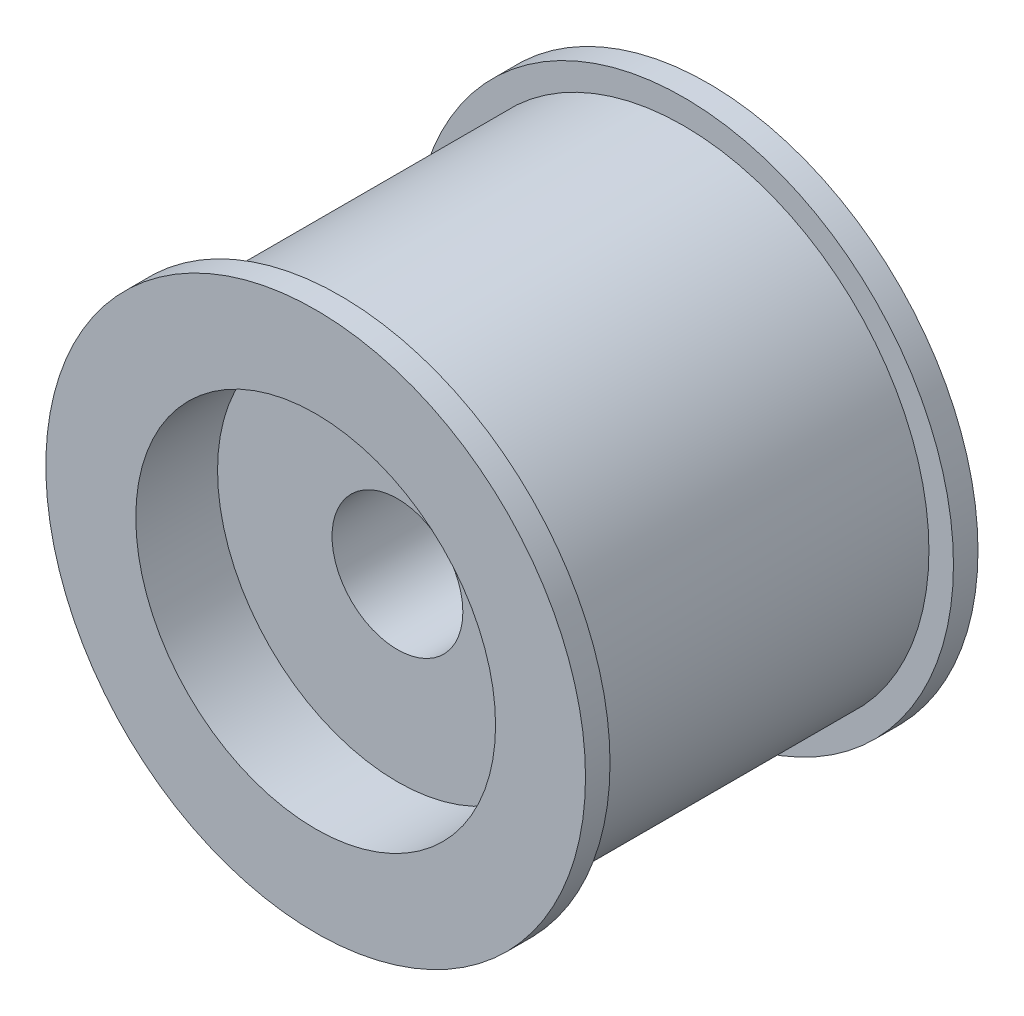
ISO-10303-21;
HEADER;
FILE_DESCRIPTION(('STEP AP214'),'2;1');
FILE_NAME('part.step','',(''),(''),'','','');
FILE_SCHEMA(('AUTOMOTIVE_DESIGN { 1 0 10303 214 1 1 1 1 }'));
ENDSEC;
DATA;
#1=APPLICATION_CONTEXT('core data for automotive mechanical design processes');
#2=APPLICATION_PROTOCOL_DEFINITION('international standard','automotive_design',2000,#1);
#3=PRODUCT_CONTEXT('',#1,'mechanical');
#4=PRODUCT('Part','Part','',(#3));
#5=PRODUCT_RELATED_PRODUCT_CATEGORY('part','',(#4));
#6=PRODUCT_DEFINITION_FORMATION('','',#4);
#7=PRODUCT_DEFINITION_CONTEXT('part definition',#1,'design');
#8=PRODUCT_DEFINITION('design','',#6,#7);
#9=PRODUCT_DEFINITION_SHAPE('','',#8);
#10=(LENGTH_UNIT() NAMED_UNIT(*) SI_UNIT(.MILLI.,.METRE.));
#11=(NAMED_UNIT(*) PLANE_ANGLE_UNIT() SI_UNIT($,.RADIAN.));
#12=(NAMED_UNIT(*) SI_UNIT($,.STERADIAN.) SOLID_ANGLE_UNIT());
#13=UNCERTAINTY_MEASURE_WITH_UNIT(LENGTH_MEASURE(1.E-05),#10,'distance_accuracy_value','');
#14=(GEOMETRIC_REPRESENTATION_CONTEXT(3) GLOBAL_UNCERTAINTY_ASSIGNED_CONTEXT((#13)) GLOBAL_UNIT_ASSIGNED_CONTEXT((#10,
#11,#12)) REPRESENTATION_CONTEXT('',''));
#15=CARTESIAN_POINT('',(0.,0.,0.));
#16=DIRECTION('',(0.,0.,1.));
#17=DIRECTION('',(1.,0.,0.));
#18=AXIS2_PLACEMENT_3D('',#15,#16,#17);
#19=CARTESIAN_POINT('',(0.,0.,18.3646380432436));
#20=DIRECTION('',(0.,0.,1.));
#21=DIRECTION('',(1.,0.,0.));
#22=AXIS2_PLACEMENT_3D('',#19,#20,#21);
#23=CYLINDRICAL_SURFACE('',#22,9.);
#24=CARTESIAN_POINT('',(0.,0.,-12.));
#25=DIRECTION('',(0.,0.,1.));
#26=DIRECTION('',(1.,0.,0.));
#27=AXIS2_PLACEMENT_3D('',#24,#25,#26);
#28=CIRCLE('',#27,9.);
#29=CARTESIAN_POINT('',(9.,0.,-12.));
#30=VERTEX_POINT('',#29);
#31=EDGE_CURVE('E8',#30,#30,#28,.T.);
#32=ORIENTED_EDGE('',*,*,#31,.F.);
#33=EDGE_LOOP('',(#32));
#34=FACE_BOUND('',#33,.T.);
#35=CARTESIAN_POINT('',(0.,0.,-7.));
#36=DIRECTION('',(0.,0.,1.));
#37=DIRECTION('',(1.,0.,0.));
#38=AXIS2_PLACEMENT_3D('',#35,#36,#37);
#39=CIRCLE('',#38,9.);
#40=CARTESIAN_POINT('',(9.,0.,-7.));
#41=VERTEX_POINT('',#40);
#42=EDGE_CURVE('E52',#41,#41,#39,.T.);
#43=ORIENTED_EDGE('',*,*,#42,.T.);
#44=EDGE_LOOP('',(#43));
#45=FACE_BOUND('',#44,.T.);
#46=ADVANCED_FACE('F12',(#34,#45),#23,.F.);
#47=CARTESIAN_POINT('',(0.,9.,-12.));
#48=DIRECTION('',(0.,0.,1.));
#49=DIRECTION('',(1.,0.,0.));
#50=AXIS2_PLACEMENT_3D('',#47,#48,#49);
#51=PLANE('',#50);
#52=CARTESIAN_POINT('',(0.,0.,-12.));
#53=DIRECTION('',(0.,0.,1.));
#54=DIRECTION('',(1.,0.,0.));
#55=AXIS2_PLACEMENT_3D('',#52,#53,#54);
#56=CIRCLE('',#55,16.5);
#57=CARTESIAN_POINT('',(16.5,0.,-12.));
#58=VERTEX_POINT('',#57);
#59=EDGE_CURVE('E18',#58,#58,#56,.T.);
#60=ORIENTED_EDGE('',*,*,#59,.F.);
#61=EDGE_LOOP('',(#60));
#62=FACE_BOUND('',#61,.T.);
#63=ORIENTED_EDGE('',*,*,#31,.T.);
#64=EDGE_LOOP('',(#63));
#65=FACE_BOUND('',#64,.T.);
#66=ADVANCED_FACE('F113',(#62,#65),#51,.F.);
#67=CARTESIAN_POINT('',(0.,0.,18.3646380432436));
#68=DIRECTION('',(0.,0.,1.));
#69=DIRECTION('',(1.,0.,0.));
#70=AXIS2_PLACEMENT_3D('',#67,#68,#69);
#71=CYLINDRICAL_SURFACE('',#70,16.5);
#72=CARTESIAN_POINT('',(0.,0.,-10.5));
#73=DIRECTION('',(0.,0.,1.));
#74=DIRECTION('',(1.,0.,0.));
#75=AXIS2_PLACEMENT_3D('',#72,#73,#74);
#76=CIRCLE('',#75,16.5);
#77=CARTESIAN_POINT('',(16.5,0.,-10.5));
#78=VERTEX_POINT('',#77);
#79=EDGE_CURVE('E22',#78,#78,#76,.T.);
#80=ORIENTED_EDGE('',*,*,#79,.F.);
#81=EDGE_LOOP('',(#80));
#82=FACE_BOUND('',#81,.T.);
#83=ORIENTED_EDGE('',*,*,#59,.T.);
#84=EDGE_LOOP('',(#83));
#85=FACE_BOUND('',#84,.T.);
#86=ADVANCED_FACE('F108',(#82,#85),#71,.T.);
#87=CARTESIAN_POINT('',(0.,16.5,-10.5));
#88=DIRECTION('',(0.,0.,-1.));
#89=DIRECTION('',(-1.,0.,0.));
#90=AXIS2_PLACEMENT_3D('',#87,#88,#89);
#91=PLANE('',#90);
#92=CARTESIAN_POINT('',(0.,0.,-10.5));
#93=DIRECTION('',(0.,0.,1.));
#94=DIRECTION('',(1.,0.,0.));
#95=AXIS2_PLACEMENT_3D('',#92,#93,#94);
#96=CIRCLE('',#95,15.);
#97=CARTESIAN_POINT('',(15.,0.,-10.5));
#98=VERTEX_POINT('',#97);
#99=EDGE_CURVE('E26',#98,#98,#96,.T.);
#100=ORIENTED_EDGE('',*,*,#99,.F.);
#101=EDGE_LOOP('',(#100));
#102=FACE_BOUND('',#101,.T.);
#103=ORIENTED_EDGE('',*,*,#79,.T.);
#104=EDGE_LOOP('',(#103));
#105=FACE_BOUND('',#104,.T.);
#106=ADVANCED_FACE('F102',(#102,#105),#91,.F.);
#107=CARTESIAN_POINT('',(0.,0.,18.3646380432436));
#108=DIRECTION('',(0.,0.,1.));
#109=DIRECTION('',(1.,0.,0.));
#110=AXIS2_PLACEMENT_3D('',#107,#108,#109);
#111=CYLINDRICAL_SURFACE('',#110,15.);
#112=CARTESIAN_POINT('',(0.,0.,10.5));
#113=DIRECTION('',(0.,0.,1.));
#114=DIRECTION('',(1.,0.,0.));
#115=AXIS2_PLACEMENT_3D('',#112,#113,#114);
#116=CIRCLE('',#115,15.);
#117=CARTESIAN_POINT('',(15.,0.,10.5));
#118=VERTEX_POINT('',#117);
#119=EDGE_CURVE('E31',#118,#118,#116,.T.);
#120=ORIENTED_EDGE('',*,*,#119,.F.);
#121=EDGE_LOOP('',(#120));
#122=FACE_BOUND('',#121,.T.);
#123=ORIENTED_EDGE('',*,*,#99,.T.);
#124=EDGE_LOOP('',(#123));
#125=FACE_BOUND('',#124,.T.);
#126=ADVANCED_FACE('F96',(#122,#125),#111,.T.);
#127=CARTESIAN_POINT('',(0.,15.,10.5));
#128=DIRECTION('',(0.,0.,1.));
#129=DIRECTION('',(1.,0.,0.));
#130=AXIS2_PLACEMENT_3D('',#127,#128,#129);
#131=PLANE('',#130);
#132=CARTESIAN_POINT('',(0.,0.,10.5));
#133=DIRECTION('',(0.,0.,1.));
#134=DIRECTION('',(1.,0.,0.));
#135=AXIS2_PLACEMENT_3D('',#132,#133,#134);
#136=CIRCLE('',#135,16.5);
#137=CARTESIAN_POINT('',(16.5,0.,10.5));
#138=VERTEX_POINT('',#137);
#139=EDGE_CURVE('E34',#138,#138,#136,.T.);
#140=ORIENTED_EDGE('',*,*,#139,.F.);
#141=EDGE_LOOP('',(#140));
#142=FACE_BOUND('',#141,.T.);
#143=ORIENTED_EDGE('',*,*,#119,.T.);
#144=EDGE_LOOP('',(#143));
#145=FACE_BOUND('',#144,.T.);
#146=ADVANCED_FACE('F90',(#142,#145),#131,.F.);
#147=CARTESIAN_POINT('',(0.,0.,18.3646380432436));
#148=DIRECTION('',(0.,0.,1.));
#149=DIRECTION('',(1.,0.,0.));
#150=AXIS2_PLACEMENT_3D('',#147,#148,#149);
#151=CYLINDRICAL_SURFACE('',#150,16.5);
#152=CARTESIAN_POINT('',(0.,0.,12.));
#153=DIRECTION('',(0.,0.,1.));
#154=DIRECTION('',(1.,0.,0.));
#155=AXIS2_PLACEMENT_3D('',#152,#153,#154);
#156=CIRCLE('',#155,16.5);
#157=CARTESIAN_POINT('',(16.5,0.,12.));
#158=VERTEX_POINT('',#157);
#159=EDGE_CURVE('E37',#158,#158,#156,.T.);
#160=ORIENTED_EDGE('',*,*,#159,.F.);
#161=EDGE_LOOP('',(#160));
#162=FACE_BOUND('',#161,.T.);
#163=ORIENTED_EDGE('',*,*,#139,.T.);
#164=EDGE_LOOP('',(#163));
#165=FACE_BOUND('',#164,.T.);
#166=ADVANCED_FACE('F84',(#162,#165),#151,.T.);
#167=CARTESIAN_POINT('',(0.,16.5,12.));
#168=DIRECTION('',(0.,0.,-1.));
#169=DIRECTION('',(-1.,0.,0.));
#170=AXIS2_PLACEMENT_3D('',#167,#168,#169);
#171=PLANE('',#170);
#172=CARTESIAN_POINT('',(0.,0.,12.));
#173=DIRECTION('',(0.,0.,1.));
#174=DIRECTION('',(1.,0.,0.));
#175=AXIS2_PLACEMENT_3D('',#172,#173,#174);
#176=CIRCLE('',#175,11.);
#177=CARTESIAN_POINT('',(11.,0.,12.));
#178=VERTEX_POINT('',#177);
#179=EDGE_CURVE('E40',#178,#178,#176,.T.);
#180=ORIENTED_EDGE('',*,*,#179,.F.);
#181=EDGE_LOOP('',(#180));
#182=FACE_BOUND('',#181,.T.);
#183=ORIENTED_EDGE('',*,*,#159,.T.);
#184=EDGE_LOOP('',(#183));
#185=FACE_BOUND('',#184,.T.);
#186=ADVANCED_FACE('F78',(#182,#185),#171,.F.);
#187=CARTESIAN_POINT('',(0.,0.,18.3646380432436));
#188=DIRECTION('',(0.,0.,1.));
#189=DIRECTION('',(1.,0.,0.));
#190=AXIS2_PLACEMENT_3D('',#187,#188,#189);
#191=CYLINDRICAL_SURFACE('',#190,11.);
#192=CARTESIAN_POINT('',(0.,0.,7.));
#193=DIRECTION('',(0.,0.,1.));
#194=DIRECTION('',(1.,0.,0.));
#195=AXIS2_PLACEMENT_3D('',#192,#193,#194);
#196=CIRCLE('',#195,11.);
#197=CARTESIAN_POINT('',(11.,0.,7.));
#198=VERTEX_POINT('',#197);
#199=EDGE_CURVE('E43',#198,#198,#196,.T.);
#200=ORIENTED_EDGE('',*,*,#199,.F.);
#201=EDGE_LOOP('',(#200));
#202=FACE_BOUND('',#201,.T.);
#203=ORIENTED_EDGE('',*,*,#179,.T.);
#204=EDGE_LOOP('',(#203));
#205=FACE_BOUND('',#204,.T.);
#206=ADVANCED_FACE('F72',(#202,#205),#191,.F.);
#207=CARTESIAN_POINT('',(0.,11.,7.));
#208=DIRECTION('',(0.,0.,-1.));
#209=DIRECTION('',(-1.,0.,0.));
#210=AXIS2_PLACEMENT_3D('',#207,#208,#209);
#211=PLANE('',#210);
#212=CARTESIAN_POINT('',(0.,0.,7.));
#213=DIRECTION('',(0.,0.,1.));
#214=DIRECTION('',(1.,0.,0.));
#215=AXIS2_PLACEMENT_3D('',#212,#213,#214);
#216=CIRCLE('',#215,4.);
#217=CARTESIAN_POINT('',(4.,0.,7.));
#218=VERTEX_POINT('',#217);
#219=EDGE_CURVE('E46',#218,#218,#216,.T.);
#220=ORIENTED_EDGE('',*,*,#219,.F.);
#221=EDGE_LOOP('',(#220));
#222=FACE_BOUND('',#221,.T.);
#223=ORIENTED_EDGE('',*,*,#199,.T.);
#224=EDGE_LOOP('',(#223));
#225=FACE_BOUND('',#224,.T.);
#226=ADVANCED_FACE('F66',(#222,#225),#211,.F.);
#227=CARTESIAN_POINT('',(0.,0.,18.3646380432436));
#228=DIRECTION('',(0.,0.,1.));
#229=DIRECTION('',(1.,0.,0.));
#230=AXIS2_PLACEMENT_3D('',#227,#228,#229);
#231=CYLINDRICAL_SURFACE('',#230,4.);
#232=CARTESIAN_POINT('',(0.,0.,-7.));
#233=DIRECTION('',(0.,0.,1.));
#234=DIRECTION('',(1.,0.,0.));
#235=AXIS2_PLACEMENT_3D('',#232,#233,#234);
#236=CIRCLE('',#235,4.);
#237=CARTESIAN_POINT('',(4.,0.,-7.));
#238=VERTEX_POINT('',#237);
#239=EDGE_CURVE('E49',#238,#238,#236,.T.);
#240=ORIENTED_EDGE('',*,*,#239,.F.);
#241=EDGE_LOOP('',(#240));
#242=FACE_BOUND('',#241,.T.);
#243=ORIENTED_EDGE('',*,*,#219,.T.);
#244=EDGE_LOOP('',(#243));
#245=FACE_BOUND('',#244,.T.);
#246=ADVANCED_FACE('F60',(#242,#245),#231,.F.);
#247=CARTESIAN_POINT('',(0.,4.,-7.));
#248=DIRECTION('',(0.,0.,1.));
#249=DIRECTION('',(1.,0.,0.));
#250=AXIS2_PLACEMENT_3D('',#247,#248,#249);
#251=PLANE('',#250);
#252=ORIENTED_EDGE('',*,*,#42,.F.);
#253=EDGE_LOOP('',(#252));
#254=FACE_BOUND('',#253,.T.);
#255=ORIENTED_EDGE('',*,*,#239,.T.);
#256=EDGE_LOOP('',(#255));
#257=FACE_BOUND('',#256,.T.);
#258=ADVANCED_FACE('F57',(#254,#257),#251,.F.);
#259=CLOSED_SHELL('',(#46,#66,#86,#106,#126,#146,#166,#186,#206,#226,#246,#258));
#260=MANIFOLD_SOLID_BREP('B1',#259);
#261=ADVANCED_BREP_SHAPE_REPRESENTATION('',(#18,#260),#14);
#262=SHAPE_DEFINITION_REPRESENTATION(#9,#261);
ENDSEC;
END-ISO-10303-21;
